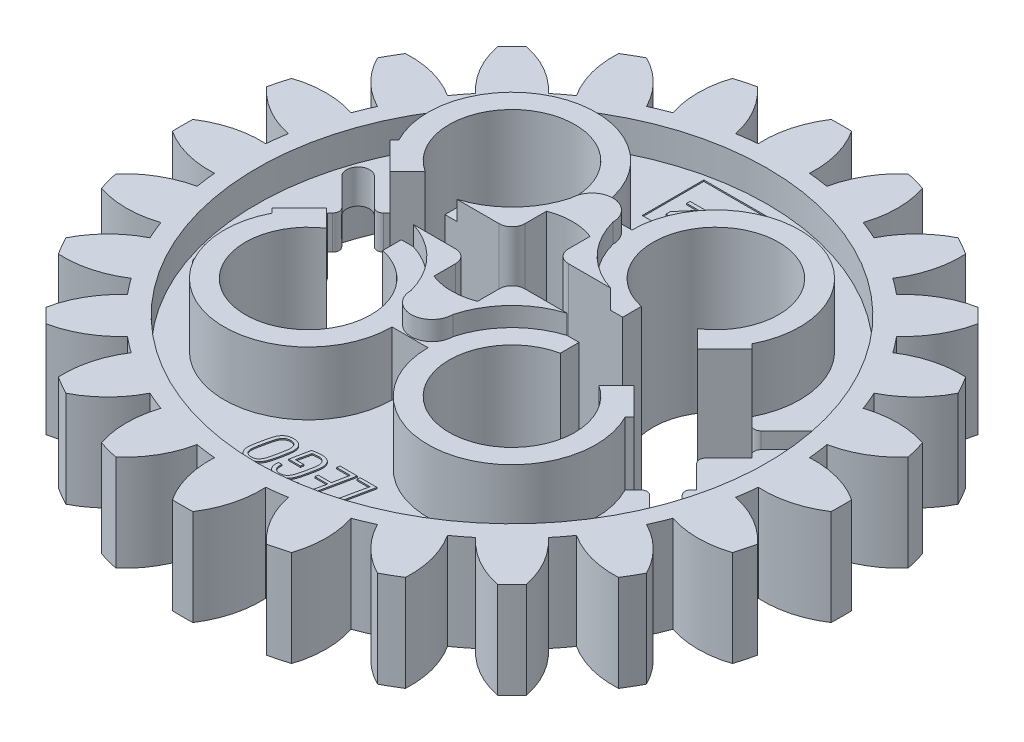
from build123d import *

# Parameters (mm, degrees)
SKETCH1_R               = 9.95
BASE_EXTRUDE_DEPTH      = 0.6625
BOSS_EXTRUDE1_DEPTH     = 3.125
BOSS_EXTRUDE2_DEPTH     = 3.875
CUT_EXTRUDE1_DEPTH      = 15.595226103
CUT_EXTRUDE1_DEPTH_BACK = 15.595226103
CUT_EXTRUDE2_DEPTH      = 15.595226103
CUT_EXTRUDE2_DEPTH_BACK = 15.595226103
SKETCH6_R               = 2.45
SKETCH7_R               = 10.65
SKETCH7_R_2             = 9.95
BOSS_EXTRUDE3_DEPTH     = 1.875
BOSS_EXTRUDE4_DEPTH     = 1.875
CIRPATTERN1_COUNT       = 24
BOSS_EXTRUDE5_DEPTH     = 3.125
MIRROR6_COPY_1_DEPTH    = 3.125
FILLET2_R               = 0.25
SKETCH12_W              = 4.1
SKETCH12_H              = 2.4
CUT_EXTRUDE3_DEPTH      = 0.05
BOSS_EXTRUDE7_DEPTH     = 0.05
BOSS_EXTRUDE8_DEPTH     = 0.05
FILLET3_R               = 0.5


with BuildPart() as part:
    # Sketch1 → Base-Extrude (new, symmetric)
    with BuildSketch(Plane(origin=(0, 0, 0), x_dir=(1, 0, 0), z_dir=(0, 1, 0))):
        with Locations(Location((0, 0, 0), (0, 0, 270))):
            Circle(SKETCH1_R)
    extrude(amount=BASE_EXTRUDE_DEPTH, both=True)

    # Sketch3 → Boss-Extrude1 (add, symmetric)
    with BuildSketch(Plane(origin=(0, 0, 0), x_dir=(1, 0, 0), z_dir=(0, 1, 0))):
        with BuildLine():
            Line((-0.7, 3.975), (0.7, 3.975))
            ThreePointArc((0.7, 3.975), (6.290774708, 6.290774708), (3.975, 0.7))
            Line((3.975, 0.7), (3.975, -0.7))
            ThreePointArc((3.975, -0.7), (6.290774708, -6.290774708), (0.7, -3.975))
            Line((0.7, -3.975), (-0.7, -3.975))
            ThreePointArc((-0.7, -3.975), (-6.290774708, -6.290774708), (-3.975, -0.7))
            Line((-3.975, -0.7), (-3.975, 0.7))
            ThreePointArc((-3.975, 0.7), (-6.290774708, 6.290774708), (-0.7, 3.975))
        make_face()
    extrude(amount=BOSS_EXTRUDE1_DEPTH, both=True)

    # Sketch4 → Boss-Extrude2 (add, symmetric)
    with BuildSketch(Plane(origin=(0, 0, 0), x_dir=(1, 0, 0), z_dir=(0, 1, 0))):
        with BuildLine():
            Line((-2.995204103, -0.85), (2.995204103, -0.85))
            ThreePointArc((2.995204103, -0.85), (1.613679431, -1.705685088), (0.813546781, -3.120109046))
            ThreePointArc((0.813546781, -3.120109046), (0, -3.933655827), (-0.813546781, -3.120109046))
            ThreePointArc((-0.813546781, -3.120109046), (-1.613679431, -1.705685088), (-2.995204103, -0.85))
        make_face()
        with BuildLine():
            Line((-2.995204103, 0.85), (2.995204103, 0.85))
            ThreePointArc((2.995204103, 0.85), (1.613679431, 1.705685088), (0.813546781, 3.120109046))
            ThreePointArc((0.813546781, 3.120109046), (0, 3.933655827), (-0.813546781, 3.120109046))
            ThreePointArc((-0.813546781, 3.120109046), (-1.613679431, 1.705685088), (-2.995204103, 0.85))
        make_face()
    extrude(amount=BOSS_EXTRUDE2_DEPTH, both=True)

    # Sketch5 → Cut-Extrude1 (cut, two sides: drawn at the far end of the back side and taken through both)
    with BuildSketch(Plane(origin=(0, 0, 0), x_dir=(1, 0, 0), z_dir=(0, 1, 0)).offset(-CUT_EXTRUDE1_DEPTH_BACK)):
        with BuildLine():
            Line((7.057402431, 2.292202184), (7.35764502, 1.991959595))
            Line((7.35764502, 1.991959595), (8.594549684, 3.228864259))
            ThreePointArc((8.594549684, 3.228864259), (9.230945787, 3.228864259), (9.230945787, 2.592468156))
            Line((9.230945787, 2.592468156), (7.994041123, 1.355563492))
            Line((7.994041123, 1.355563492), (8.276883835, 1.072720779))
            Line((8.276883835, 1.072720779), (7.204163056, 0))
            Line((7.204163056, 0), (8.276883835, -1.072720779))
            Line((8.276883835, -1.072720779), (7.994041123, -1.355563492))
            Line((7.994041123, -1.355563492), (9.230945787, -2.592468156))
            ThreePointArc((9.230945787, -2.592468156), (9.230945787, -3.228864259), (8.594549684, -3.228864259))
            Line((8.594549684, -3.228864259), (7.35764502, -1.991959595))
            Line((7.35764502, -1.991959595), (7.057402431, -2.292202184))
            Line((7.057402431, -2.292202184), (6, -1.234799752))
            Line((6, -1.234799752), (4.925197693, -2.30960206))
            Line((4.925197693, -2.30960206), (3.465595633, -2.30960206))
            Line((3.465595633, -2.30960206), (3.465595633, -0.85))
            Line((3.465595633, -0.85), (0.85, -0.85))
            Line((0.85, -0.85), (0.85, -2.19625249))
            ThreePointArc((0.85, -2.19625249), (0, -2.355), (-0.85, -2.19625249))
            Line((-0.85, -2.19625249), (-0.85, -0.85))
            Line((-0.85, -0.85), (-3.465595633, -0.85))
            Line((-3.465595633, -0.85), (-3.465595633, -2.30960206))
            Line((-3.465595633, -2.30960206), (-4.925197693, -2.30960206))
            Line((-4.925197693, -2.30960206), (-6, -1.234799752))
            Line((-6, -1.234799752), (-7.057402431, -2.292202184))
            Line((-7.057402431, -2.292202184), (-7.35764502, -1.991959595))
            Line((-7.35764502, -1.991959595), (-8.594549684, -3.228864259))
            ThreePointArc((-8.594549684, -3.228864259), (-9.230945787, -3.228864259), (-9.230945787, -2.592468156))
            Line((-9.230945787, -2.592468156), (-7.994041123, -1.355563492))
            Line((-7.994041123, -1.355563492), (-8.276883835, -1.072720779))
            Line((-8.276883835, -1.072720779), (-7.204163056, 0))
            Line((-7.204163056, 0), (-8.276883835, 1.072720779))
            Line((-8.276883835, 1.072720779), (-7.994041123, 1.355563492))
            Line((-7.994041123, 1.355563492), (-9.230945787, 2.592468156))
            ThreePointArc((-9.230945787, 2.592468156), (-9.230945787, 3.228864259), (-8.594549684, 3.228864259))
            Line((-8.594549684, 3.228864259), (-7.35764502, 1.991959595))
            Line((-7.35764502, 1.991959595), (-7.057402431, 2.292202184))
            Line((-7.057402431, 2.292202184), (-6, 1.234799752))
            Line((-6, 1.234799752), (-4.925197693, 2.30960206))
            Line((-4.925197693, 2.30960206), (-3.465595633, 2.30960206))
            Line((-3.465595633, 2.30960206), (-3.465595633, 0.85))
            Line((-3.465595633, 0.85), (-0.85, 0.85))
            Line((-0.85, 0.85), (-0.85, 2.19625249))
            ThreePointArc((-0.85, 2.19625249), (0, 2.355), (0.85, 2.19625249))
            Line((0.85, 2.19625249), (0.85, 0.85))
            Line((0.85, 0.85), (3.465595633, 0.85))
            Line((3.465595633, 0.85), (3.465595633, 2.30960206))
            Line((3.465595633, 2.30960206), (4.925197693, 2.30960206))
            Line((4.925197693, 2.30960206), (6, 1.234799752))
            Line((6, 1.234799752), (7.057402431, 2.292202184))
        make_face()
    extrude(amount=CUT_EXTRUDE1_DEPTH + CUT_EXTRUDE1_DEPTH_BACK, mode=Mode.SUBTRACT)

    # Sketch6 → Cut-Extrude2 (cut, two sides: drawn at the far end of the back side and taken through both)
    with BuildSketch(Plane(origin=(0, 0, 0), x_dir=(1, 0, 0), z_dir=(0, 1, 0)).offset(-CUT_EXTRUDE2_DEPTH_BACK)):
        with Locations((3.975, 3.975)):
            Circle(SKETCH6_R)
        with Locations((3.975, -3.975)):
            Circle(SKETCH6_R)
        with Locations((-3.975, -3.975)):
            Circle(SKETCH6_R)
        with Locations((-3.975, 3.975)):
            Circle(SKETCH6_R)
    extrude(amount=CUT_EXTRUDE2_DEPTH + CUT_EXTRUDE2_DEPTH_BACK, mode=Mode.SUBTRACT)

    # Sketch7 → Boss-Extrude3 (add, symmetric)
    with BuildSketch(Plane(origin=(0, 0, 0), x_dir=(1, 0, 0), z_dir=(0, 1, 0))):
        with Locations(Location((0, 0, 0), (0, 0, 270))):
            Circle(SKETCH7_R)
        with Locations(Location((0, 0, 0), (0, 0, 270))):
            Circle(SKETCH7_R_2, mode=Mode.SUBTRACT)
    extrude(amount=BOSS_EXTRUDE3_DEPTH, both=True)

    # Sketch9 → Boss-Extrude4 (add, symmetric)
    with BuildSketch(Plane(origin=(0, 0, 0), x_dir=(1, 0, 0), z_dir=(0, 1, 0))):
        with BuildLine():
            ThreePointArc((1, 10.602947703), (0, 10.65), (-1, 10.602947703))
            ThreePointArc((-1, 10.602947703), (-0.877992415, 11.771019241), (-0.4, 12.84377281))
            ThreePointArc((-0.4, 12.84377281), (0, 12.85), (0.4, 12.84377281))
            ThreePointArc((0.4, 12.84377281), (0.877992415, 11.771019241), (1, 10.602947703))
        make_face()
    boss_extrude4 = extrude(amount=BOSS_EXTRUDE4_DEPTH, both=True)

    # CirPattern1: Boss-Extrude4 ×24 about axis
    cirpattern1_axis = Axis((0, 0, 0), (0, 1, 0))
    for i in range(1, CIRPATTERN1_COUNT):
        add(boss_extrude4.rotate(cirpattern1_axis, i * 360 / CIRPATTERN1_COUNT))

    # Sketch10 → Boss-Extrude5 (add, symmetric)
    with BuildSketch(Plane(origin=(0, 0, 0), x_dir=(1, 0, 0), z_dir=(0, 1, 0))):
        with BuildLine():
            Line((6, 1.234799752), (5.905397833, 1.329401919))
            ThreePointArc((5.905397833, 1.329401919), (6.459864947, 1.841676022), (6.882309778, 2.467294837))
            Line((6.882309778, 2.467294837), (7.057402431, 2.292202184))
            Line((7.057402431, 2.292202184), (6, 1.234799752))
        make_face()
    boss_extrude5 = extrude(amount=BOSS_EXTRUDE5_DEPTH, both=True)

    # Mirror1: Boss-Extrude5 across plane
    add(boss_extrude5.mirror(Plane.XY))

    # Mirror6: Boss-Extrude5 across plane
    add(boss_extrude5.mirror(Plane(origin=(0, 0, 0), x_dir=(0, 0, 1), z_dir=(1, 0, 0))))

    # Mirror6 copy 1 sketch → Mirror6 copy 1 (add, symmetric)
    with BuildSketch(Plane(origin=(0, 0, 0), x_dir=(-1, 0, 0), z_dir=(0, 1, 0))):
        with BuildLine():
            Line((6, 1.234799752), (5.905397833, 1.329401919))
            ThreePointArc((5.905397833, 1.329401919), (6.459864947, 1.841676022), (6.882309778, 2.467294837))
            Line((6.882309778, 2.467294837), (7.057402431, 2.292202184))
            Line((7.057402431, 2.292202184), (6, 1.234799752))
        make_face()
    extrude(amount=MIRROR6_COPY_1_DEPTH, both=True)

    # Fillet2
    fillet2_edges = [part.edges().sort_by_distance(p)[0] for p in [
        (7.35764502, 0, -1.991959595),
        (7.994041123, 0, -1.355563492),
        (7.204163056, 0, 0),
        (7.994041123, 0, 1.355563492),
        (7.35764502, 0, 1.991959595),
        (-7.35764502, 0, 1.991959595),
        (-7.994041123, 0, 1.355563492),
        (-7.204163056, 0, 0),
        (-7.994041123, 0, -1.355563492),
        (-7.35764502, 0, -1.991959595),
    ]]
    fillet(fillet2_edges, radius=FILLET2_R)

    # Sketch12 → Cut-Extrude3 (cut)
    with BuildSketch(Plane(origin=(0, 0.6625, 0), x_dir=(-1, 0, 0), z_dir=(0, 1, 0))):
        with Locations((0, -8.329177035)):
            Rectangle(SKETCH12_W, SKETCH12_H)
    extrude(amount=-CUT_EXTRUDE3_DEPTH, mode=Mode.SUBTRACT)

    # Sketch13 → Boss-Extrude7 (add)
    with BuildSketch(Plane(origin=(3.103945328, 0.6125, -7.148146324), x_dir=(1, 0, 0), z_dir=(0, 1, 0))):
        Polygon((-4.73746676, 0.659797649), (-4.223577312, 1.256077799), (-4.698977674, 1.256077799), (-4.698977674, 1.390789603), (-4.044663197, 1.390789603), (-4.044663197, 1.208567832), (-4.54622411, 0.621007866), (-4.025418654, 0.621007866), (-4.025418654, 0.486296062), (-4.73746676, 0.486296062), align=None)
        with BuildLine():
            Line((-3.264357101, 1.126778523), (-3.115813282, 1.231420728))
            add(Edge.make_bspline(
                [(-3.115813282, 1.231420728), (-3.099198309, 1.243013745), (-3.068094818, 1.264716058), (-3.027149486, 1.298552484), (-2.993784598, 1.329731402), (-2.968767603, 1.360435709), (-2.950278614, 1.391079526), (-2.937618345, 1.422974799), (-2.929723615, 1.456558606), (-2.928898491, 1.47955147), (-2.928479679, 1.491222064)],
                knots=[0, 0, 0, 0, 1.450563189, 2.715477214, 3.802089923, 4.715931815, 5.543363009, 6.355292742, 7.165188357, 8, 8, 8, 8], degree=3))
            add(Edge.make_bspline(
                [(-2.928479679, 1.491222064), (-2.929199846, 1.504043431), (-2.930615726, 1.529250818), (-2.942857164, 1.5654029), (-2.963335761, 1.597820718), (-2.990881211, 1.626275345), (-3.024076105, 1.649917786), (-3.062161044, 1.667408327), (-3.104542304, 1.677776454), (-3.134197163, 1.678885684), (-3.149491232, 1.679457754)],
                knots=[0, 0, 0, 0, 0.949503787, 1.86676737, 2.795478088, 3.773903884, 4.787212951, 5.802240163, 6.866536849, 8, 8, 8, 8], degree=3))
            add(Edge.make_bspline(
                [(-3.149491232, 1.679457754), (-3.161338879, 1.67899188), (-3.185973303, 1.678023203), (-3.223860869, 1.671763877), (-3.26377617, 1.661232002), (-3.306149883, 1.647059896), (-3.351183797, 1.627998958), (-3.399735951, 1.60470388), (-3.451894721, 1.576788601), (-3.487356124, 1.555715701), (-3.505815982, 1.54474595)],
                knots=[0, 0, 0, 0, 0.738142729, 1.534796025, 2.385970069, 3.308145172, 4.315906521, 5.430329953, 6.662327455, 8, 8, 8, 8], degree=3))
            Line((-3.505815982, 1.54474595), (-3.505815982, 1.736589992))
            add(Edge.make_bspline(
                [(-3.505815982, 1.736589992), (-3.492988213, 1.744385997), (-3.467516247, 1.759866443), (-3.427587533, 1.779876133), (-3.386354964, 1.796257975), (-3.343906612, 1.810015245), (-3.299955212, 1.820465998), (-3.254341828, 1.827968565), (-3.20701968, 1.832585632), (-3.174860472, 1.833134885), (-3.158512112, 1.833414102)],
                knots=[0, 0, 0, 0, 0.985044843, 1.95599334, 2.927253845, 3.894741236, 4.882506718, 5.889476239, 6.927100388, 8, 8, 8, 8], degree=3))
            add(Edge.make_bspline(
                [(-3.158512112, 1.833414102), (-3.142565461, 1.833133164), (-3.111507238, 1.832585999), (-3.066238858, 1.828119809), (-3.023625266, 1.820246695), (-2.983544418, 1.809528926), (-2.945998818, 1.795622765), (-2.911007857, 1.778803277), (-2.878516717, 1.758925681), (-2.849184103, 1.735675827), (-2.822536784, 1.710123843), (-2.799309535, 1.682092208), (-2.779623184, 1.651827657), (-2.763529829, 1.619353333), (-2.751203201, 1.584610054), (-2.742631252, 1.547680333), (-2.736972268, 1.508635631), (-2.736352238, 1.481820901), (-2.736034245, 1.468068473)],
                knots=[0, 0, 0, 0, 1.212581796, 2.36166437, 3.454561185, 4.50483997, 5.512975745, 6.494833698, 7.453122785, 8.403130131, 9.335730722, 10.256070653, 11.165199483, 12.075382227, 13.006018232, 13.961878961, 14.954712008, 16, 16, 16, 16], degree=3))
            add(Edge.make_bspline(
                [(-2.736034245, 1.468068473), (-2.736687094, 1.450368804), (-2.737976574, 1.415409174), (-2.749486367, 1.364352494), (-2.768423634, 1.316012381), (-2.794747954, 1.269659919), (-2.830245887, 1.225161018), (-2.87411717, 1.180694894), (-2.927476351, 1.136034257), (-2.96752619, 1.108305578), (-2.988618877, 1.093701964)],
                knots=[0, 0, 0, 0, 0.898260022, 1.774204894, 2.643195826, 3.528034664, 4.471237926, 5.526250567, 6.697172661, 8, 8, 8, 8], degree=3))
            Line((-2.988618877, 1.093701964), (-3.109799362, 1.010108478))
            add(Edge.make_bspline(
                [(-3.109799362, 1.010108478), (-3.120059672, 1.00284238), (-3.139956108, 0.988752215), (-3.168321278, 0.967403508), (-3.194107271, 0.946448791), (-3.217422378, 0.925928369), (-3.238149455, 0.905906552), (-3.256248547, 0.886270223), (-3.272070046, 0.867313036), (-3.28959598, 0.842677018), (-3.307171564, 0.810601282), (-3.322046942, 0.769442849), (-3.330881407, 0.725524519), (-3.332030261, 0.695320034), (-3.332615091, 0.67994428)],
                knots=[0, 0, 0, 0, 1.084678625, 2.103371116, 3.062279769, 3.950628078, 4.782327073, 5.547284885, 6.253693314, 6.911138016, 8.15341544, 9.395361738, 10.67409506, 12, 12, 12, 12], degree=3))
            Line((-3.332615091, 0.67994428), (-3.332615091, 0.64025241))
            Line((-3.332615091, 0.64025241), (-2.755278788, 0.64025241))
            Line((-2.755278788, 0.64025241), (-2.755278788, 0.486296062))
            Line((-2.755278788, 0.486296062), (-3.525060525, 0.486296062))
            add(Edge.make_bspline(
                [(-3.525060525, 0.486296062), (-3.525728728, 0.491602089), (-3.527061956, 0.502188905), (-3.527934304, 0.51956352), (-3.528119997, 0.540821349), (-3.528086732, 0.556759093), (-3.528067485, 0.5659805)],
                knots=[0, 0, 0, 0, 0.803803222, 1.603783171, 2.613574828, 4, 4, 4, 4], degree=3))
            add(Edge.make_bspline(
                [(-3.528067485, 0.5659805), (-3.527892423, 0.583022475), (-3.527551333, 0.616226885), (-3.524961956, 0.664708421), (-3.519972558, 0.710415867), (-3.513953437, 0.753546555), (-3.505390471, 0.793964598), (-3.495367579, 0.831784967), (-3.483218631, 0.866918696), (-3.469398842, 0.899801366), (-3.452839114, 0.930896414), (-3.433761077, 0.960905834), (-3.412528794, 0.990634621), (-3.38778892, 1.019013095), (-3.36121516, 1.047540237), (-3.331314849, 1.074673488), (-3.298966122, 1.101325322), (-3.276067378, 1.118166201), (-3.264357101, 1.126778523)],
                knots=[0, 0, 0, 0, 1.257671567, 2.450434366, 3.580977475, 4.650081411, 5.662675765, 6.628022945, 7.535645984, 8.403957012, 9.257652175, 10.131897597, 11.027046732, 11.950506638, 12.908028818, 13.902687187, 14.927447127, 16, 16, 16, 16], degree=3))
        make_face()
        Polygon((-1.793051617, 0.794208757), (-2.293409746, 0.794208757), (-2.293409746, 0.983346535), (-1.90460983, 1.794925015), (-1.718479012, 1.794925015), (-2.12291512, 0.948165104), (-1.793051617, 0.948165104), (-1.793051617, 1.217588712), (-1.619850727, 1.217588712), (-1.619850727, 0.948165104), (-1.446649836, 0.948165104), (-1.446649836, 0.794208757), (-1.619850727, 0.794208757), (-1.619850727, 0.486296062), (-1.793051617, 0.486296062), align=None)
    extrude(amount=BOSS_EXTRUDE7_DEPTH)

    # Sketch14 → Boss-Extrude8 (add)
    # profile 1 of 4: a face of its own
    with BuildSketch(Plane(origin=(0.40664557, 0.6625, 8.268459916), x_dir=(-1, 0, 0), z_dir=(0, 1, 0))):
        Polygon((-1.603990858, -0.994022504), (-1.28735798, 0.507051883), (-1.148135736, 0.507051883), (-1.445223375, -0.878555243), (-0.930431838, -0.878555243), (-0.95508891, -0.994022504), align=None)
    # profile 2 of 4: a face of its own
    with BuildSketch(Plane(origin=(0.40664557, 0.6625, 8.268459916), x_dir=(-1, 0, 0), z_dir=(0, 1, 0))):
        Polygon((-0.834209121, -0.994022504), (-0.520282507, 0.507051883), (0.147262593, 0.507051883), (0.12350761, 0.391584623), (-0.41353543, 0.391584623), (-0.530205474, -0.147262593), (-0.025938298, -0.147262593), (-0.048490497, -0.262729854), (-0.552456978, -0.262729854), (-0.676945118, -0.878555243), (-0.141405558, -0.878555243), (-0.16305567, -0.994022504), align=None)
    # profile 3 of 4: a face of its own
    with BuildSketch(Plane(origin=(0.40664557, 0.6625, 8.268459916), x_dir=(-1, 0, 0), z_dir=(0, 1, 0))):
        with BuildLine():
            add(Edge.make_bspline(
                [(0.921254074, -0.966959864), (0.903422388, -0.970518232), (0.868701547, -0.977446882), (0.817871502, -0.986724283), (0.769693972, -0.995001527), (0.724167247, -1.001555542), (0.681365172, -1.006798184), (0.641341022, -1.010263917), (0.604158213, -1.013026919), (0.580269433, -1.013189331), (0.568838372, -1.013267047)],
                knots=[0, 0, 0, 0, 1.225832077, 2.386870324, 3.483325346, 4.521138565, 5.487527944, 6.389900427, 7.229548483, 8, 8, 8, 8], degree=3))
            add(Edge.make_bspline(
                [(0.568838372, -1.013267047), (0.551986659, -1.013023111), (0.519212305, -1.012548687), (0.471681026, -1.007605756), (0.427330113, -0.999907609), (0.386094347, -0.989170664), (0.348142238, -0.975011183), (0.313203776, -0.957942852), (0.281748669, -0.937249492), (0.253275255, -0.913778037), (0.228128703, -0.887104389), (0.20636733, -0.857393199), (0.187858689, -0.824746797), (0.173257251, -0.788871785), (0.161521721, -0.750336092), (0.15304121, -0.708775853), (0.148407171, -0.664264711), (0.147650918, -0.633598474), (0.147262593, -0.617851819)],
                knots=[0, 0, 0, 0, 1.222313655, 2.377238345, 3.462882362, 4.486000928, 5.464004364, 6.397432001, 7.301091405, 8.189403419, 9.069130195, 9.953503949, 10.85555242, 11.784749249, 12.757873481, 13.774795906, 14.85739087, 16, 16, 16, 16], degree=3))
            add(Edge.make_bspline(
                [(0.147262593, -0.617851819), (0.14755655, -0.606019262), (0.148197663, -0.580212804), (0.15171317, -0.538478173), (0.157515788, -0.49045183), (0.164304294, -0.446524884), (0.170419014, -0.407714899), (0.176348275, -0.375712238), (0.182102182, -0.341349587), (0.189293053, -0.305052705), (0.196300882, -0.266385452), (0.204542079, -0.225632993), (0.213219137, -0.18262486), (0.219314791, -0.153273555), (0.222436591, -0.138241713)],
                knots=[0, 0, 0, 0, 0.876487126, 1.911592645, 3.100341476, 4.458879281, 5.203351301, 6.010101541, 6.869316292, 7.783654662, 8.750433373, 9.779746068, 10.862929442, 12, 12, 12, 12], degree=3))
            add(Edge.make_bspline(
                [(0.222436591, -0.138241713), (0.225720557, -0.123301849), (0.232094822, -0.094303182), (0.241798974, -0.052022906), (0.251101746, -0.012126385), (0.259968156, 0.02542555), (0.269103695, 0.060355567), (0.277847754, 0.092924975), (0.286160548, 0.123127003), (0.296763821, 0.159313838), (0.309862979, 0.20008108), (0.326054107, 0.244039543), (0.341943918, 0.281887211), (0.353984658, 0.304258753), (0.359553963, 0.314606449)],
                knots=[0, 0, 0, 0, 1.160392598, 2.252352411, 3.290740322, 4.268182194, 5.179221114, 6.029501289, 6.826431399, 7.555467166, 8.890004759, 10.073631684, 11.108980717, 12, 12, 12, 12], degree=3))
            add(Edge.make_bspline(
                [(0.359553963, 0.314606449), (0.371098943, 0.333191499), (0.393609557, 0.369428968), (0.434748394, 0.416895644), (0.479811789, 0.457135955), (0.529540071, 0.489815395), (0.584192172, 0.514984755), (0.643665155, 0.532954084), (0.708283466, 0.543574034), (0.752923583, 0.544870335), (0.77601791, 0.54554097)],
                knots=[0, 0, 0, 0, 1.045860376, 2.039237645, 2.994234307, 3.929665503, 4.876250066, 5.864225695, 6.895068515, 8, 8, 8, 8], degree=3))
            add(Edge.make_bspline(
                [(0.77601791, 0.54554097), (0.791064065, 0.545265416), (0.820425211, 0.544727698), (0.863163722, 0.540173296), (0.903393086, 0.532680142), (0.941021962, 0.52233978), (0.975846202, 0.508560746), (1.008350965, 0.492511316), (1.037946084, 0.472672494), (1.065078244, 0.45021182), (1.089106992, 0.424906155), (1.110162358, 0.397220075), (1.127924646, 0.3670495), (1.142434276, 0.334356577), (1.153419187, 0.299302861), (1.161642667, 0.262001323), (1.166472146, 0.222220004), (1.166968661, 0.194842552), (1.167223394, 0.180796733)],
                knots=[0, 0, 0, 0, 1.187988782, 2.318247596, 3.389450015, 4.41694543, 5.394441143, 6.343149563, 7.273990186, 8.201324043, 9.119525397, 10.023491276, 10.942545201, 11.878052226, 12.841830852, 13.83862194, 14.891119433, 16, 16, 16, 16], degree=3))
            add(Edge.make_bspline(
                [(1.167223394, 0.180796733), (1.167052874, 0.175483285), (1.166659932, 0.163239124), (1.165187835, 0.142551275), (1.161923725, 0.117334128), (1.159509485, 0.099006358), (1.158202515, 0.089084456)],
                knots=[0, 0, 0, 0, 0.691807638, 1.594182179, 2.69758897, 4, 4, 4, 4], degree=3))
            Line((1.158202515, 0.089084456), (1.158202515, 0.083671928))
            Line((1.158202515, 0.083671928), (1.026196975, 0.083671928))
            add(Edge.make_bspline(
                [(1.026196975, 0.083671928), (1.027283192, 0.090678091), (1.029341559, 0.103954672), (1.031022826, 0.123446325), (1.032413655, 0.141786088), (1.032479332, 0.153831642), (1.03251159, 0.159748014)],
                knots=[0, 0, 0, 0, 1.112961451, 2.109046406, 3.071227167, 4, 4, 4, 4], degree=3))
            add(Edge.make_bspline(
                [(1.03251159, 0.159748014), (1.032232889, 0.170177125), (1.031690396, 0.190477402), (1.028874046, 0.219990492), (1.023332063, 0.247632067), (1.015874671, 0.273515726), (1.006332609, 0.297817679), (0.994124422, 0.320024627), (0.980328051, 0.340813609), (0.964017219, 0.359355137), (0.945897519, 0.376032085), (0.925898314, 0.390515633), (0.904183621, 0.402972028), (0.880487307, 0.412811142), (0.855151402, 0.420742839), (0.828007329, 0.425952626), (0.799158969, 0.429391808), (0.779336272, 0.429841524), (0.769101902, 0.430073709)],
                knots=[0, 0, 0, 0, 1.166547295, 2.270685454, 3.310422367, 4.31425725, 5.280012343, 6.222860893, 7.143051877, 8.064607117, 8.976914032, 9.89162764, 10.820312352, 11.769601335, 12.755186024, 13.783929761, 14.855852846, 16, 16, 16, 16], degree=3))
            add(Edge.make_bspline(
                [(0.769101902, 0.430073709), (0.752216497, 0.429557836), (0.719373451, 0.428554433), (0.672162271, 0.419022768), (0.628825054, 0.4036666), (0.589364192, 0.38201031), (0.553529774, 0.353654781), (0.521057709, 0.318566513), (0.490934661, 0.277020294), (0.474339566, 0.245776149), (0.465699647, 0.229509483)],
                knots=[0, 0, 0, 0, 1.048026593, 2.038469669, 2.978039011, 3.894986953, 4.821840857, 5.804264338, 6.85683226, 8, 8, 8, 8], degree=3))
            add(Edge.make_bspline(
                [(0.465699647, 0.229509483), (0.461462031, 0.220643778), (0.452132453, 0.201124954), (0.439959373, 0.168000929), (0.426934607, 0.129121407), (0.416464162, 0.092756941), (0.407261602, 0.06032397), (0.40065947, 0.032725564), (0.392960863, 0.002927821), (0.385128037, -0.02934614), (0.377214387, -0.064097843), (0.368231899, -0.101077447), (0.359739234, -0.140566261), (0.353662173, -0.167614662), (0.350533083, -0.181541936)],
                knots=[0, 0, 0, 0, 0.826735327, 1.820148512, 2.967388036, 4.278160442, 5.00481677, 5.804905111, 6.666383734, 7.595406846, 8.600254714, 9.666453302, 10.798452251, 12, 12, 12, 12], degree=3))
            add(Edge.make_bspline(
                [(0.350533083, -0.181541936), (0.347247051, -0.197483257), (0.340901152, -0.228268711), (0.331421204, -0.272497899), (0.323491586, -0.313370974), (0.315681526, -0.350561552), (0.309675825, -0.384537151), (0.303663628, -0.414817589), (0.299387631, -0.441656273), (0.294067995, -0.471730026), (0.289644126, -0.504946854), (0.285214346, -0.540703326), (0.282690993, -0.571809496), (0.282200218, -0.590986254), (0.281974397, -0.599810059)],
                knots=[0, 0, 0, 0, 1.380724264, 2.666417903, 3.83700122, 4.912538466, 5.889783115, 6.763609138, 7.531013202, 8.194978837, 9.354142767, 10.372930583, 11.251336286, 12, 12, 12, 12], degree=3))
            add(Edge.make_bspline(
                [(0.281974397, -0.599810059), (0.2821898, -0.611146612), (0.282608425, -0.633178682), (0.286299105, -0.665263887), (0.292250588, -0.695461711), (0.300663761, -0.723873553), (0.311521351, -0.750477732), (0.324713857, -0.775246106), (0.340528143, -0.797992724), (0.358600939, -0.818728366), (0.378641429, -0.837452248), (0.400932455, -0.853400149), (0.424582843, -0.867341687), (0.450245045, -0.878530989), (0.477540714, -0.887273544), (0.506808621, -0.893094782), (0.53764802, -0.897247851), (0.558900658, -0.89761336), (0.56974046, -0.897799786)],
                knots=[0, 0, 0, 0, 1.159097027, 2.25265184, 3.298060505, 4.303502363, 5.27816348, 6.232119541, 7.167667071, 8.105010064, 9.040782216, 9.96554058, 10.902659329, 11.843582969, 12.822654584, 13.827887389, 14.892124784, 16, 16, 16, 16], degree=3))
            add(Edge.make_bspline(
                [(0.56974046, -0.897799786), (0.590601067, -0.897465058), (0.631392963, -0.896810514), (0.691390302, -0.891329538), (0.749168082, -0.881958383), (0.786410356, -0.872045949), (0.804884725, -0.867128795)],
                knots=[0, 0, 0, 0, 1.052006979, 2.057148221, 3.036230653, 4, 4, 4, 4], degree=3))
            Line((0.804884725, -0.867128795), (0.923358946, -0.339708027))
            Line((0.923358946, -0.339708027), (0.589887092, -0.339708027))
            Line((0.589887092, -0.339708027), (0.614844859, -0.224240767))
            Line((0.614844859, -0.224240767), (1.071000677, -0.224240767))
            Line((1.071000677, -0.224240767), (0.968162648, -0.739633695))
            add(Edge.make_bspline(
                [(0.968162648, -0.739633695), (0.964606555, -0.755359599), (0.957234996, -0.78795841), (0.948583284, -0.829895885), (0.941506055, -0.866327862), (0.935526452, -0.897126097), (0.928546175, -0.930971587), (0.923752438, -0.954629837), (0.921254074, -0.966959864)],
                knots=[0, 0, 0, 0, 1.25022728, 2.591642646, 3.320264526, 4.128149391, 5.0244431, 6, 6, 6, 6], degree=3))
        make_face()
    # profile 4 of 4: a face of its own
    with BuildSketch(Plane(origin=(0.40664557, 0.6625, 8.268459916), x_dir=(-1, 0, 0), z_dir=(0, 1, 0))):
        with BuildLine():
            add(Edge.make_bspline(
                [(1.263446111, -0.625669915), (1.263709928, -0.613334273), (1.264294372, -0.586006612), (1.268562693, -0.541369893), (1.275344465, -0.48916698), (1.284435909, -0.429425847), (1.2957979, -0.362029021), (1.310271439, -0.287370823), (1.325874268, -0.205152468), (1.338004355, -0.14814166), (1.344333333, -0.118395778)],
                knots=[0, 0, 0, 0, 0.575618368, 1.2751913, 2.090889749, 3.032200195, 4.094896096, 5.28012256, 6.580880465, 8, 8, 8, 8], degree=3))
            add(Edge.make_bspline(
                [(1.344333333, -0.118395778), (1.349580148, -0.093499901), (1.359765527, -0.045170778), (1.377315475, 0.024534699), (1.394002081, 0.089905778), (1.41207693, 0.149749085), (1.429549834, 0.203418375), (1.446123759, 0.249553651), (1.461852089, 0.287631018), (1.473297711, 0.309558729), (1.478443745, 0.319417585)],
                knots=[0, 0, 0, 0, 1.329892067, 2.581652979, 3.757237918, 4.856338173, 5.848855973, 6.707462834, 7.418866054, 8, 8, 8, 8], degree=3))
            add(Edge.make_bspline(
                [(1.478443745, 0.319417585), (1.484357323, 0.329004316), (1.496009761, 0.347894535), (1.514926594, 0.374653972), (1.534813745, 0.39926267), (1.55525417, 0.422101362), (1.576926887, 0.442440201), (1.599298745, 0.46081614), (1.622181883, 0.477634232), (1.654606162, 0.496922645), (1.69881889, 0.516915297), (1.757064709, 0.53347488), (1.820963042, 0.543924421), (1.865496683, 0.544988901), (1.888593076, 0.54554097)],
                knots=[0, 0, 0, 0, 0.82075713, 1.617264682, 2.386162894, 3.125665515, 3.849083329, 4.549605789, 5.234880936, 5.916369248, 7.29592212, 8.756850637, 10.318011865, 12, 12, 12, 12], degree=3))
            add(Edge.make_bspline(
                [(1.888593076, 0.54554097), (1.90414387, 0.545303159), (1.934322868, 0.544841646), (1.978141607, 0.53982339), (2.019244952, 0.532213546), (2.057507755, 0.52108532), (2.092958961, 0.506880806), (2.125693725, 0.489817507), (2.155434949, 0.469141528), (2.182181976, 0.445326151), (2.206182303, 0.418669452), (2.227004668, 0.389102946), (2.244404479, 0.356611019), (2.259127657, 0.321574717), (2.269561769, 0.283382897), (2.277836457, 0.242735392), (2.282667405, 0.199154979), (2.283155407, 0.169181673), (2.283406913, 0.153734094)],
                knots=[0, 0, 0, 0, 1.175277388, 2.280828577, 3.330169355, 4.332652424, 5.288203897, 6.213680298, 7.11765186, 8.019524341, 8.915743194, 9.824056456, 10.746424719, 11.697819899, 12.690920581, 13.734278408, 14.832297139, 16, 16, 16, 16], degree=3))
            add(Edge.make_bspline(
                [(2.283406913, 0.153734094), (2.283121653, 0.142301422), (2.282502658, 0.117493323), (2.278829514, 0.077189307), (2.273544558, 0.030836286), (2.266978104, -0.011798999), (2.26073638, -0.04944961), (2.255350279, -0.081246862), (2.248936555, -0.115691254), (2.242138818, -0.153019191), (2.234217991, -0.192873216), (2.225845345, -0.235501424), (2.216454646, -0.280772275), (2.210033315, -0.311943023), (2.206729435, -0.327980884)],
                knots=[0, 0, 0, 0, 0.842807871, 1.828834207, 2.981748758, 4.28162173, 5.007991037, 5.795100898, 6.658829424, 7.590630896, 8.591902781, 9.654024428, 10.792957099, 12, 12, 12, 12], degree=3))
            add(Edge.make_bspline(
                [(2.206729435, -0.327980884), (2.203221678, -0.344018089), (2.196424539, -0.375094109), (2.186524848, -0.420326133), (2.176998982, -0.462547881), (2.16758675, -0.501819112), (2.158686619, -0.538035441), (2.149905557, -0.571300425), (2.141472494, -0.601540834), (2.131388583, -0.637154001), (2.119054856, -0.676875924), (2.103320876, -0.719486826), (2.087809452, -0.75637916), (2.07579502, -0.778206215), (2.070213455, -0.788346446)],
                knots=[0, 0, 0, 0, 1.226824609, 2.37727363, 3.460296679, 4.461369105, 5.395165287, 6.247276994, 7.032354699, 7.741269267, 9.013447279, 10.139147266, 11.135500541, 12, 12, 12, 12], degree=3))
            add(Edge.make_bspline(
                [(2.070213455, -0.788346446), (2.064739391, -0.797756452), (2.053977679, -0.81625601), (2.035620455, -0.842182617), (2.016688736, -0.866490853), (1.996191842, -0.888616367), (1.975030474, -0.909051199), (1.952592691, -0.927523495), (1.929078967, -0.944118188), (1.904343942, -0.958879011), (1.878341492, -0.971917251), (1.850960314, -0.982967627), (1.822242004, -0.992373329), (1.792055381, -0.999797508), (1.760432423, -1.005767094), (1.7273403, -1.010429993), (1.692770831, -1.012657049), (1.669287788, -1.013061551), (1.657357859, -1.013267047)],
                knots=[0, 0, 0, 0, 1.052351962, 2.068866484, 3.069589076, 4.030112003, 4.98312133, 5.91277099, 6.837962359, 7.763965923, 8.696038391, 9.648307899, 10.617013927, 11.616232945, 12.652386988, 13.728578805, 14.84606553, 16, 16, 16, 16], degree=3))
            add(Edge.make_bspline(
                [(1.657357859, -1.013267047), (1.642109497, -1.013016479), (1.612433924, -1.012528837), (1.569270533, -1.007653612), (1.52883215, -0.999570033), (1.490989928, -0.988398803), (1.455613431, -0.974371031), (1.422897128, -0.956851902), (1.393023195, -0.935953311), (1.365763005, -0.912169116), (1.341689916, -0.88520586), (1.320495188, -0.855783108), (1.303078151, -0.823519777), (1.288544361, -0.788990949), (1.277079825, -0.751841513), (1.269104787, -0.712049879), (1.264172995, -0.669696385), (1.263692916, -0.640618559), (1.263446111, -0.625669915)],
                knots=[0, 0, 0, 0, 1.16414172, 2.265592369, 3.311935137, 4.309808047, 5.274966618, 6.213345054, 7.137059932, 8.05373864, 8.969777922, 9.891651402, 10.816570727, 11.763403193, 12.74883821, 13.780177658, 14.858809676, 16, 16, 16, 16], degree=3))
        make_face()
        with BuildLine():
            add(Edge.make_bspline(
                [(1.879872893, 0.430073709), (1.862690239, 0.429654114), (1.829585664, 0.428845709), (1.782448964, 0.419915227), (1.739938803, 0.405941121), (1.701855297, 0.385658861), (1.667707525, 0.358224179), (1.636282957, 0.323643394), (1.607052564, 0.281492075), (1.59054416, 0.249763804), (1.581883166, 0.233117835)],
                knots=[0, 0, 0, 0, 1.080335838, 2.08140476, 3.007134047, 3.887802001, 4.781481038, 5.750383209, 6.819757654, 8, 8, 8, 8], degree=3))
            add(Edge.make_bspline(
                [(1.581883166, 0.233117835), (1.578275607, 0.225240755), (1.569991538, 0.207152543), (1.55869186, 0.175597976), (1.545983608, 0.136616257), (1.532845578, 0.090604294), (1.518827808, 0.038675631), (1.504419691, -0.018044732), (1.489946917, -0.079186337), (1.48077793, -0.121486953), (1.476038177, -0.143353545)],
                knots=[0, 0, 0, 0, 0.530694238, 1.218638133, 2.051874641, 3.043172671, 4.150157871, 5.347821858, 6.629001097, 8, 8, 8, 8], degree=3))
            add(Edge.make_bspline(
                [(1.476038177, -0.143353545), (1.472607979, -0.159887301), (1.465979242, -0.191838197), (1.456703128, -0.238375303), (1.447872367, -0.281834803), (1.440235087, -0.322383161), (1.432784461, -0.359806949), (1.426686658, -0.394245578), (1.420759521, -0.425663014), (1.414702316, -0.46236016), (1.408123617, -0.502979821), (1.402759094, -0.546415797), (1.399126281, -0.583012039), (1.398457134, -0.605216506), (1.398157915, -0.615145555)],
                knots=[0, 0, 0, 0, 1.269945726, 2.454125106, 3.568819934, 4.605187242, 5.557279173, 6.438514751, 7.235470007, 7.961690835, 9.235746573, 10.329704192, 11.25310301, 12, 12, 12, 12], degree=3))
            add(Edge.make_bspline(
                [(1.398157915, -0.615145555), (1.398402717, -0.625979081), (1.398882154, -0.647196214), (1.402208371, -0.678061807), (1.407550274, -0.707040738), (1.415082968, -0.73415974), (1.424951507, -0.759354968), (1.437072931, -0.78272427), (1.451277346, -0.804201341), (1.467528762, -0.823842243), (1.485882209, -0.841337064), (1.506272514, -0.856404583), (1.52819906, -0.869532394), (1.552281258, -0.879652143), (1.5778638, -0.887708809), (1.605178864, -0.893935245), (1.634432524, -0.897039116), (1.654545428, -0.897541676), (1.664875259, -0.897799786)],
                knots=[0, 0, 0, 0, 1.177093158, 2.305301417, 3.369110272, 4.375974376, 5.358932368, 6.303989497, 7.231370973, 8.151754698, 9.068522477, 9.979058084, 10.901823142, 11.838559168, 12.809923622, 13.814074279, 14.877325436, 16, 16, 16, 16], degree=3))
            add(Edge.make_bspline(
                [(1.664875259, -0.897799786), (1.681756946, -0.897255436), (1.714259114, -0.896207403), (1.760915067, -0.88726178), (1.803392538, -0.872998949), (1.842022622, -0.852411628), (1.876930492, -0.824883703), (1.908802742, -0.790463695), (1.938215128, -0.749218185), (1.954420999, -0.718205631), (1.962864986, -0.702046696)],
                knots=[0, 0, 0, 0, 1.066706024, 2.053720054, 2.991776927, 3.890687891, 4.807366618, 5.789382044, 6.848168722, 8, 8, 8, 8], degree=3))
            add(Edge.make_bspline(
                [(1.962864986, -0.702046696), (1.966864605, -0.692962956), (1.975644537, -0.673022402), (1.987800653, -0.639696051), (1.999961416, -0.600363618), (2.013023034, -0.554754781), (2.026902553, -0.501830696), (2.041480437, -0.440719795), (2.057436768, -0.371260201), (2.068159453, -0.32207857), (2.073821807, -0.296107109)],
                knots=[0, 0, 0, 0, 0.565071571, 1.240440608, 2.018442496, 2.909050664, 3.941793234, 5.133691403, 6.486381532, 8, 8, 8, 8], degree=3))
            add(Edge.make_bspline(
                [(2.073821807, -0.296107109), (2.077345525, -0.279772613), (2.08415236, -0.248218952), (2.093728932, -0.202603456), (2.102502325, -0.160416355), (2.110315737, -0.121625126), (2.117255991, -0.086246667), (2.123155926, -0.054232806), (2.128814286, -0.02574616), (2.134047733, 0.006980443), (2.140023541, 0.042973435), (2.144663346, 0.081710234), (2.14810564, 0.114883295), (2.148510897, 0.135184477), (2.148695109, 0.144412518)],
                knots=[0, 0, 0, 0, 1.344629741, 2.597447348, 3.750577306, 4.811939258, 5.781569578, 6.65158919, 7.431436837, 8.118277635, 9.318319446, 10.366731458, 11.257586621, 12, 12, 12, 12], degree=3))
            add(Edge.make_bspline(
                [(2.148695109, 0.144412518), (2.148409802, 0.155541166), (2.147856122, 0.17713795), (2.145134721, 0.208688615), (2.139152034, 0.238053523), (2.131954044, 0.265690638), (2.121722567, 0.29098922), (2.110197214, 0.314866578), (2.095600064, 0.336330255), (2.079343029, 0.356129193), (2.060959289, 0.373596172), (2.040538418, 0.388776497), (2.018401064, 0.401715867), (1.994197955, 0.411996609), (1.968288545, 0.420015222), (1.940465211, 0.426203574), (1.910714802, 0.429302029), (1.890302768, 0.429812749), (1.879872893, 0.430073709)],
                knots=[0, 0, 0, 0, 1.196268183, 2.321535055, 3.396668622, 4.413069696, 5.38507652, 6.324309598, 7.256289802, 8.1664195, 9.072973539, 9.973364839, 10.895145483, 11.821445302, 12.792258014, 13.806259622, 14.879071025, 16, 16, 16, 16], degree=3))
        make_face(mode=Mode.SUBTRACT)
    extrude(amount=BOSS_EXTRUDE8_DEPTH)

    # Fillet3
    fillet3_edges = [part.edges().sort_by_distance(p)[0] for p in [
        (0.85, 0, -0.85),
        (-0.85, 0, 0.85),
        (0.85, 0, 0.85),
        (-0.85, 0, -0.85),
    ]]
    fillet(fillet3_edges, radius=FILLET3_R)


solid = part.part
